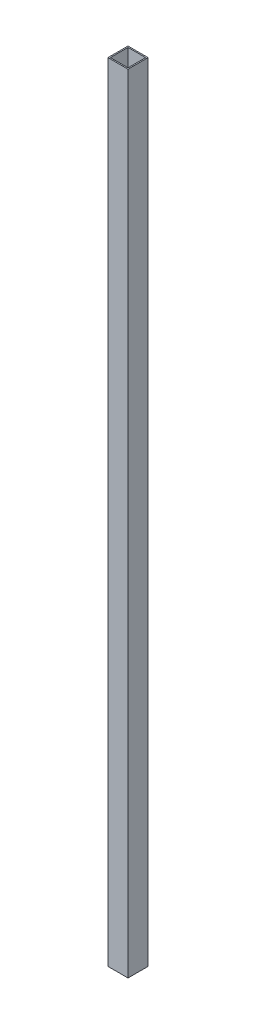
ISO-10303-21;
HEADER;
FILE_DESCRIPTION(('STEP AP214'),'2;1');
FILE_NAME('part.step','',(''),(''),'','','');
FILE_SCHEMA(('AUTOMOTIVE_DESIGN { 1 0 10303 214 1 1 1 1 }'));
ENDSEC;
DATA;
#1=APPLICATION_CONTEXT('core data for automotive mechanical design processes');
#2=APPLICATION_PROTOCOL_DEFINITION('international standard','automotive_design',2000,#1);
#3=PRODUCT_CONTEXT('',#1,'mechanical');
#4=PRODUCT('Part','Part','',(#3));
#5=PRODUCT_RELATED_PRODUCT_CATEGORY('part','',(#4));
#6=PRODUCT_DEFINITION_FORMATION('','',#4);
#7=PRODUCT_DEFINITION_CONTEXT('part definition',#1,'design');
#8=PRODUCT_DEFINITION('design','',#6,#7);
#9=PRODUCT_DEFINITION_SHAPE('','',#8);
#10=(LENGTH_UNIT() NAMED_UNIT(*) SI_UNIT(.MILLI.,.METRE.));
#11=(NAMED_UNIT(*) PLANE_ANGLE_UNIT() SI_UNIT($,.RADIAN.));
#12=(NAMED_UNIT(*) SI_UNIT($,.STERADIAN.) SOLID_ANGLE_UNIT());
#13=UNCERTAINTY_MEASURE_WITH_UNIT(LENGTH_MEASURE(1.E-05),#10,'distance_accuracy_value','');
#14=(GEOMETRIC_REPRESENTATION_CONTEXT(3) GLOBAL_UNCERTAINTY_ASSIGNED_CONTEXT((#13)) GLOBAL_UNIT_ASSIGNED_CONTEXT((#10,
#11,#12)) REPRESENTATION_CONTEXT('',''));
#15=CARTESIAN_POINT('',(0.,0.,0.));
#16=DIRECTION('',(0.,0.,1.));
#17=DIRECTION('',(1.,0.,0.));
#18=AXIS2_PLACEMENT_3D('',#15,#16,#17);
#19=CARTESIAN_POINT('',(0.,1960.,-50.));
#20=DIRECTION('',(0.,-1.,0.));
#21=DIRECTION('',(0.,0.,-1.));
#22=AXIS2_PLACEMENT_3D('',#19,#20,#21);
#23=PLANE('',#22);
#24=DIRECTION('',(0.,0.,1.));
#25=VECTOR('',#24,1.);
#26=CARTESIAN_POINT('',(0.,1960.,0.));
#27=LINE('',#26,#25);
#28=CARTESIAN_POINT('',(0.,1960.,-50.));
#29=VERTEX_POINT('',#28);
#30=CARTESIAN_POINT('',(0.,1960.,0.));
#31=VERTEX_POINT('',#30);
#32=EDGE_CURVE('E135',#29,#31,#27,.T.);
#33=ORIENTED_EDGE('',*,*,#32,.T.);
#34=DIRECTION('',(1.,0.,0.));
#35=VECTOR('',#34,1.);
#36=CARTESIAN_POINT('',(0.,1960.,0.));
#37=LINE('',#36,#35);
#38=CARTESIAN_POINT('',(50.,1960.,0.));
#39=VERTEX_POINT('',#38);
#40=EDGE_CURVE('E138',#31,#39,#37,.T.);
#41=ORIENTED_EDGE('',*,*,#40,.T.);
#42=DIRECTION('',(0.,0.,-1.));
#43=VECTOR('',#42,1.);
#44=CARTESIAN_POINT('',(50.,1960.,0.));
#45=LINE('',#44,#43);
#46=CARTESIAN_POINT('',(50.,1960.,-50.));
#47=VERTEX_POINT('',#46);
#48=EDGE_CURVE('E141',#39,#47,#45,.T.);
#49=ORIENTED_EDGE('',*,*,#48,.T.);
#50=DIRECTION('',(-1.,0.,0.));
#51=VECTOR('',#50,1.);
#52=CARTESIAN_POINT('',(0.,1960.,-50.));
#53=LINE('',#52,#51);
#54=EDGE_CURVE('E143',#47,#29,#53,.T.);
#55=ORIENTED_EDGE('',*,*,#54,.T.);
#56=EDGE_LOOP('',(#33,#41,#49,#55));
#57=FACE_BOUND('',#56,.T.);
#58=DIRECTION('',(0.,0.,1.));
#59=VECTOR('',#58,1.);
#60=CARTESIAN_POINT('',(3.,1960.,-47.));
#61=LINE('',#60,#59);
#62=CARTESIAN_POINT('',(3.,1960.,-47.));
#63=VERTEX_POINT('',#62);
#64=CARTESIAN_POINT('',(3.00000000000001,1960.,-3.));
#65=VERTEX_POINT('',#64);
#66=EDGE_CURVE('E99',#63,#65,#61,.T.);
#67=ORIENTED_EDGE('',*,*,#66,.F.);
#68=DIRECTION('',(-1.,0.,0.));
#69=VECTOR('',#68,1.);
#70=CARTESIAN_POINT('',(3.,1960.,-47.));
#71=LINE('',#70,#69);
#72=CARTESIAN_POINT('',(47.,1960.,-47.));
#73=VERTEX_POINT('',#72);
#74=EDGE_CURVE('E121',#73,#63,#71,.T.);
#75=ORIENTED_EDGE('',*,*,#74,.F.);
#76=DIRECTION('',(0.,0.,-1.));
#77=VECTOR('',#76,1.);
#78=CARTESIAN_POINT('',(47.,1960.,-47.));
#79=LINE('',#78,#77);
#80=CARTESIAN_POINT('',(47.,1960.,-3.));
#81=VERTEX_POINT('',#80);
#82=EDGE_CURVE('E119',#81,#73,#79,.T.);
#83=ORIENTED_EDGE('',*,*,#82,.F.);
#84=DIRECTION('',(1.,0.,0.));
#85=VECTOR('',#84,1.);
#86=CARTESIAN_POINT('',(3.00000000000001,1960.,-3.));
#87=LINE('',#86,#85);
#88=EDGE_CURVE('E107',#65,#81,#87,.T.);
#89=ORIENTED_EDGE('',*,*,#88,.F.);
#90=EDGE_LOOP('',(#67,#75,#83,#89));
#91=FACE_BOUND('',#90,.T.);
#92=ADVANCED_FACE('F34',(#57,#91),#23,.F.);
#93=CARTESIAN_POINT('',(0.,0.,-50.));
#94=DIRECTION('',(0.,-1.,0.));
#95=DIRECTION('',(0.,0.,-1.));
#96=AXIS2_PLACEMENT_3D('',#93,#94,#95);
#97=PLANE('',#96);
#98=DIRECTION('',(0.,0.,1.));
#99=VECTOR('',#98,1.);
#100=CARTESIAN_POINT('',(0.,0.,0.));
#101=LINE('',#100,#99);
#102=CARTESIAN_POINT('',(0.,0.,-50.));
#103=VERTEX_POINT('',#102);
#104=CARTESIAN_POINT('',(0.,0.,0.));
#105=VERTEX_POINT('',#104);
#106=EDGE_CURVE('E115',#103,#105,#101,.T.);
#107=ORIENTED_EDGE('',*,*,#106,.F.);
#108=DIRECTION('',(-1.,0.,0.));
#109=VECTOR('',#108,1.);
#110=CARTESIAN_POINT('',(0.,0.,-50.));
#111=LINE('',#110,#109);
#112=CARTESIAN_POINT('',(50.,0.,-50.));
#113=VERTEX_POINT('',#112);
#114=EDGE_CURVE('E139',#113,#103,#111,.T.);
#115=ORIENTED_EDGE('',*,*,#114,.F.);
#116=DIRECTION('',(0.,0.,-1.));
#117=VECTOR('',#116,1.);
#118=CARTESIAN_POINT('',(50.,0.,0.));
#119=LINE('',#118,#117);
#120=CARTESIAN_POINT('',(50.,0.,0.));
#121=VERTEX_POINT('',#120);
#122=EDGE_CURVE('E150',#121,#113,#119,.T.);
#123=ORIENTED_EDGE('',*,*,#122,.F.);
#124=DIRECTION('',(1.,0.,0.));
#125=VECTOR('',#124,1.);
#126=CARTESIAN_POINT('',(0.,0.,0.));
#127=LINE('',#126,#125);
#128=EDGE_CURVE('E148',#105,#121,#127,.T.);
#129=ORIENTED_EDGE('',*,*,#128,.F.);
#130=EDGE_LOOP('',(#107,#115,#123,#129));
#131=FACE_BOUND('',#130,.T.);
#132=DIRECTION('',(-1.,0.,0.));
#133=VECTOR('',#132,1.);
#134=CARTESIAN_POINT('',(3.,0.,-47.));
#135=LINE('',#134,#133);
#136=CARTESIAN_POINT('',(47.,0.,-47.));
#137=VERTEX_POINT('',#136);
#138=CARTESIAN_POINT('',(3.,0.,-47.));
#139=VERTEX_POINT('',#138);
#140=EDGE_CURVE('E108',#137,#139,#135,.T.);
#141=ORIENTED_EDGE('',*,*,#140,.T.);
#142=DIRECTION('',(0.,0.,1.));
#143=VECTOR('',#142,1.);
#144=CARTESIAN_POINT('',(3.,0.,-47.));
#145=LINE('',#144,#143);
#146=CARTESIAN_POINT('',(3.00000000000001,0.,-3.));
#147=VERTEX_POINT('',#146);
#148=EDGE_CURVE('E57',#139,#147,#145,.T.);
#149=ORIENTED_EDGE('',*,*,#148,.T.);
#150=DIRECTION('',(1.,0.,0.));
#151=VECTOR('',#150,1.);
#152=CARTESIAN_POINT('',(3.00000000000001,0.,-3.));
#153=LINE('',#152,#151);
#154=CARTESIAN_POINT('',(47.,0.,-3.));
#155=VERTEX_POINT('',#154);
#156=EDGE_CURVE('E114',#147,#155,#153,.T.);
#157=ORIENTED_EDGE('',*,*,#156,.T.);
#158=DIRECTION('',(0.,0.,-1.));
#159=VECTOR('',#158,1.);
#160=CARTESIAN_POINT('',(47.,0.,-47.));
#161=LINE('',#160,#159);
#162=EDGE_CURVE('E127',#155,#137,#161,.T.);
#163=ORIENTED_EDGE('',*,*,#162,.T.);
#164=EDGE_LOOP('',(#141,#149,#157,#163));
#165=FACE_BOUND('',#164,.T.);
#166=ADVANCED_FACE('F168',(#131,#165),#97,.T.);
#167=CARTESIAN_POINT('',(0.,1960.,0.));
#168=DIRECTION('',(1.,0.,0.));
#169=DIRECTION('',(0.,0.,-1.));
#170=AXIS2_PLACEMENT_3D('',#167,#168,#169);
#171=PLANE('',#170);
#172=ORIENTED_EDGE('',*,*,#106,.T.);
#173=DIRECTION('',(0.,-1.,0.));
#174=VECTOR('',#173,1.);
#175=CARTESIAN_POINT('',(0.,1960.,0.));
#176=LINE('',#175,#174);
#177=EDGE_CURVE('E11',#31,#105,#176,.T.);
#178=ORIENTED_EDGE('',*,*,#177,.F.);
#179=ORIENTED_EDGE('',*,*,#32,.F.);
#180=DIRECTION('',(0.,-1.,0.));
#181=VECTOR('',#180,1.);
#182=CARTESIAN_POINT('',(0.,1960.,-50.));
#183=LINE('',#182,#181);
#184=EDGE_CURVE('E145',#29,#103,#183,.T.);
#185=ORIENTED_EDGE('',*,*,#184,.T.);
#186=EDGE_LOOP('',(#172,#178,#179,#185));
#187=FACE_BOUND('',#186,.T.);
#188=ADVANCED_FACE('F36',(#187),#171,.F.);
#189=CARTESIAN_POINT('',(0.,1960.,0.));
#190=DIRECTION('',(0.,0.,-1.));
#191=DIRECTION('',(-1.,0.,0.));
#192=AXIS2_PLACEMENT_3D('',#189,#190,#191);
#193=PLANE('',#192);
#194=ORIENTED_EDGE('',*,*,#128,.T.);
#195=DIRECTION('',(0.,-1.,0.));
#196=VECTOR('',#195,1.);
#197=CARTESIAN_POINT('',(50.,1960.,0.));
#198=LINE('',#197,#196);
#199=EDGE_CURVE('E42',#39,#121,#198,.T.);
#200=ORIENTED_EDGE('',*,*,#199,.F.);
#201=ORIENTED_EDGE('',*,*,#40,.F.);
#202=ORIENTED_EDGE('',*,*,#177,.T.);
#203=EDGE_LOOP('',(#194,#200,#201,#202));
#204=FACE_BOUND('',#203,.T.);
#205=ADVANCED_FACE('F178',(#204),#193,.F.);
#206=CARTESIAN_POINT('',(50.,1960.,0.));
#207=DIRECTION('',(-1.,0.,0.));
#208=DIRECTION('',(0.,0.,1.));
#209=AXIS2_PLACEMENT_3D('',#206,#207,#208);
#210=PLANE('',#209);
#211=ORIENTED_EDGE('',*,*,#122,.T.);
#212=DIRECTION('',(0.,-1.,0.));
#213=VECTOR('',#212,1.);
#214=CARTESIAN_POINT('',(50.,1960.,-50.));
#215=LINE('',#214,#213);
#216=EDGE_CURVE('E155',#47,#113,#215,.T.);
#217=ORIENTED_EDGE('',*,*,#216,.F.);
#218=ORIENTED_EDGE('',*,*,#48,.F.);
#219=ORIENTED_EDGE('',*,*,#199,.T.);
#220=EDGE_LOOP('',(#211,#217,#218,#219));
#221=FACE_BOUND('',#220,.T.);
#222=ADVANCED_FACE('F162',(#221),#210,.F.);
#223=CARTESIAN_POINT('',(0.,1960.,-50.));
#224=DIRECTION('',(0.,0.,1.));
#225=DIRECTION('',(1.,0.,0.));
#226=AXIS2_PLACEMENT_3D('',#223,#224,#225);
#227=PLANE('',#226);
#228=ORIENTED_EDGE('',*,*,#114,.T.);
#229=ORIENTED_EDGE('',*,*,#184,.F.);
#230=ORIENTED_EDGE('',*,*,#54,.F.);
#231=ORIENTED_EDGE('',*,*,#216,.T.);
#232=EDGE_LOOP('',(#228,#229,#230,#231));
#233=FACE_BOUND('',#232,.T.);
#234=ADVANCED_FACE('F172',(#233),#227,.F.);
#235=CARTESIAN_POINT('',(3.,1960.,-47.));
#236=DIRECTION('',(1.,0.,0.));
#237=DIRECTION('',(0.,0.,-1.));
#238=AXIS2_PLACEMENT_3D('',#235,#236,#237);
#239=PLANE('',#238);
#240=ORIENTED_EDGE('',*,*,#148,.F.);
#241=DIRECTION('',(0.,-1.,0.));
#242=VECTOR('',#241,1.);
#243=CARTESIAN_POINT('',(3.,1960.,-47.));
#244=LINE('',#243,#242);
#245=EDGE_CURVE('E103',#63,#139,#244,.T.);
#246=ORIENTED_EDGE('',*,*,#245,.F.);
#247=ORIENTED_EDGE('',*,*,#66,.T.);
#248=DIRECTION('',(0.,-1.,0.));
#249=VECTOR('',#248,1.);
#250=CARTESIAN_POINT('',(3.00000000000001,1960.,-3.));
#251=LINE('',#250,#249);
#252=EDGE_CURVE('E102',#65,#147,#251,.T.);
#253=ORIENTED_EDGE('',*,*,#252,.T.);
#254=EDGE_LOOP('',(#240,#246,#247,#253));
#255=FACE_BOUND('',#254,.T.);
#256=ADVANCED_FACE('F101',(#255),#239,.T.);
#257=CARTESIAN_POINT('',(3.00000000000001,1960.,-3.));
#258=DIRECTION('',(0.,0.,-1.));
#259=DIRECTION('',(-1.,0.,0.));
#260=AXIS2_PLACEMENT_3D('',#257,#258,#259);
#261=PLANE('',#260);
#262=ORIENTED_EDGE('',*,*,#156,.F.);
#263=ORIENTED_EDGE('',*,*,#252,.F.);
#264=ORIENTED_EDGE('',*,*,#88,.T.);
#265=DIRECTION('',(0.,-1.,0.));
#266=VECTOR('',#265,1.);
#267=CARTESIAN_POINT('',(47.,1960.,-3.));
#268=LINE('',#267,#266);
#269=EDGE_CURVE('E116',#81,#155,#268,.T.);
#270=ORIENTED_EDGE('',*,*,#269,.T.);
#271=EDGE_LOOP('',(#262,#263,#264,#270));
#272=FACE_BOUND('',#271,.T.);
#273=ADVANCED_FACE('F111',(#272),#261,.T.);
#274=CARTESIAN_POINT('',(47.,1960.,-47.));
#275=DIRECTION('',(-1.,0.,0.));
#276=DIRECTION('',(0.,0.,1.));
#277=AXIS2_PLACEMENT_3D('',#274,#275,#276);
#278=PLANE('',#277);
#279=ORIENTED_EDGE('',*,*,#162,.F.);
#280=ORIENTED_EDGE('',*,*,#269,.F.);
#281=ORIENTED_EDGE('',*,*,#82,.T.);
#282=DIRECTION('',(0.,-1.,0.));
#283=VECTOR('',#282,1.);
#284=CARTESIAN_POINT('',(47.,1960.,-47.));
#285=LINE('',#284,#283);
#286=EDGE_CURVE('E49',#73,#137,#285,.T.);
#287=ORIENTED_EDGE('',*,*,#286,.T.);
#288=EDGE_LOOP('',(#279,#280,#281,#287));
#289=FACE_BOUND('',#288,.T.);
#290=ADVANCED_FACE('F201',(#289),#278,.T.);
#291=CARTESIAN_POINT('',(3.,1960.,-47.));
#292=DIRECTION('',(0.,0.,1.));
#293=DIRECTION('',(1.,0.,0.));
#294=AXIS2_PLACEMENT_3D('',#291,#292,#293);
#295=PLANE('',#294);
#296=ORIENTED_EDGE('',*,*,#140,.F.);
#297=ORIENTED_EDGE('',*,*,#286,.F.);
#298=ORIENTED_EDGE('',*,*,#74,.T.);
#299=ORIENTED_EDGE('',*,*,#245,.T.);
#300=EDGE_LOOP('',(#296,#297,#298,#299));
#301=FACE_BOUND('',#300,.T.);
#302=ADVANCED_FACE('F205',(#301),#295,.T.);
#303=CLOSED_SHELL('',(#92,#166,#188,#205,#222,#234,#256,#273,#290,#302));
#304=MANIFOLD_SOLID_BREP('B2',#303);
#305=ADVANCED_BREP_SHAPE_REPRESENTATION('',(#18,#304),#14);
#306=SHAPE_DEFINITION_REPRESENTATION(#9,#305);
ENDSEC;
END-ISO-10303-21;
